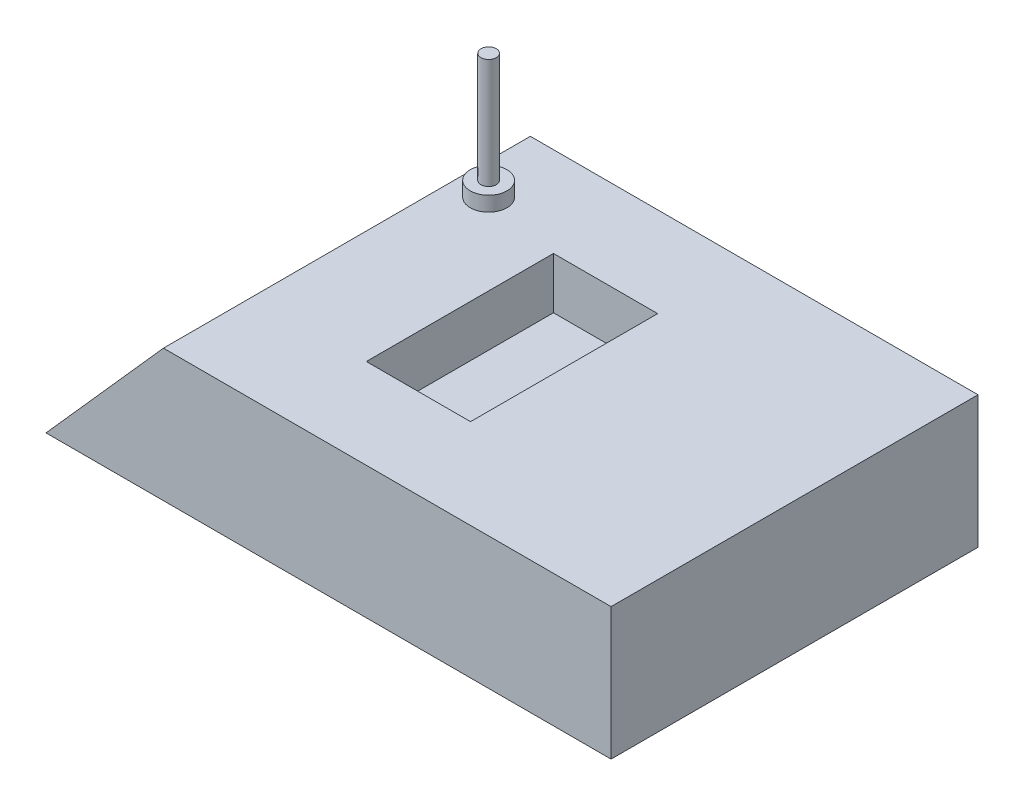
ISO-10303-21;
HEADER;
FILE_DESCRIPTION(('STEP AP214'),'2;1');
FILE_NAME('part.step','',(''),(''),'','','');
FILE_SCHEMA(('AUTOMOTIVE_DESIGN { 1 0 10303 214 1 1 1 1 }'));
ENDSEC;
DATA;
#1=APPLICATION_CONTEXT('core data for automotive mechanical design processes');
#2=APPLICATION_PROTOCOL_DEFINITION('international standard','automotive_design',2000,#1);
#3=PRODUCT_CONTEXT('',#1,'mechanical');
#4=PRODUCT('Part','Part','',(#3));
#5=PRODUCT_RELATED_PRODUCT_CATEGORY('part','',(#4));
#6=PRODUCT_DEFINITION_FORMATION('','',#4);
#7=PRODUCT_DEFINITION_CONTEXT('part definition',#1,'design');
#8=PRODUCT_DEFINITION('design','',#6,#7);
#9=PRODUCT_DEFINITION_SHAPE('','',#8);
#10=(LENGTH_UNIT() NAMED_UNIT(*) SI_UNIT(.MILLI.,.METRE.));
#11=(NAMED_UNIT(*) PLANE_ANGLE_UNIT() SI_UNIT($,.RADIAN.));
#12=(NAMED_UNIT(*) SI_UNIT($,.STERADIAN.) SOLID_ANGLE_UNIT());
#13=UNCERTAINTY_MEASURE_WITH_UNIT(LENGTH_MEASURE(1.E-05),#10,'distance_accuracy_value','');
#14=(GEOMETRIC_REPRESENTATION_CONTEXT(3) GLOBAL_UNCERTAINTY_ASSIGNED_CONTEXT((#13)) GLOBAL_UNIT_ASSIGNED_CONTEXT((#10,
#11,#12)) REPRESENTATION_CONTEXT('',''));
#15=CARTESIAN_POINT('',(0.,0.,0.));
#16=DIRECTION('',(0.,0.,1.));
#17=DIRECTION('',(1.,0.,0.));
#18=AXIS2_PLACEMENT_3D('',#15,#16,#17);
#19=CARTESIAN_POINT('',(-385.,0.,-250.));
#20=DIRECTION('',(0.74740931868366,-0.66436383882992,0.));
#21=DIRECTION('',(0.66436383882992,0.74740931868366,0.));
#22=AXIS2_PLACEMENT_3D('',#19,#20,#21);
#23=PLANE('',#22);
#24=CARTESIAN_POINT('',(-305.,90.,126.057791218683));
#25=DIRECTION('',(0.74740931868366,-0.66436383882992,0.));
#26=DIRECTION('',(-0.66436383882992,-0.74740931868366,0.));
#27=AXIS2_PLACEMENT_3D('',#24,#25,#26);
#28=ELLIPSE('',#27,112.889949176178,75.);
#29=CARTESIAN_POINT('',(-367.222222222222,20.,167.931351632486));
#30=VERTEX_POINT('',#29);
#31=CARTESIAN_POINT('',(-367.222222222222,20.,84.1842308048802));
#32=VERTEX_POINT('',#31);
#33=EDGE_CURVE('E123',#30,#32,#28,.F.);
#34=ORIENTED_EDGE('',*,*,#33,.F.);
#35=DIRECTION('',(0.,0.,1.));
#36=VECTOR('',#35,1.);
#37=CARTESIAN_POINT('',(-367.222222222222,20.,-250.));
#38=LINE('',#37,#36);
#39=EDGE_CURVE('E126',#32,#30,#38,.T.);
#40=ORIENTED_EDGE('',*,*,#39,.F.);
#41=EDGE_LOOP('',(#34,#40));
#42=FACE_BOUND('',#41,.T.);
#43=DIRECTION('',(0.66436383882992,0.74740931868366,0.));
#44=VECTOR('',#43,1.);
#45=CARTESIAN_POINT('',(-385.,0.,250.));
#46=LINE('',#45,#44);
#47=CARTESIAN_POINT('',(-385.,0.,250.));
#48=VERTEX_POINT('',#47);
#49=CARTESIAN_POINT('',(-225.,180.,250.));
#50=VERTEX_POINT('',#49);
#51=EDGE_CURVE('E98',#48,#50,#46,.T.);
#52=ORIENTED_EDGE('',*,*,#51,.T.);
#53=DIRECTION('',(0.,0.,1.));
#54=VECTOR('',#53,1.);
#55=CARTESIAN_POINT('',(-225.,180.,-250.));
#56=LINE('',#55,#54);
#57=CARTESIAN_POINT('',(-225.,180.,-250.));
#58=VERTEX_POINT('',#57);
#59=EDGE_CURVE('E94',#58,#50,#56,.T.);
#60=ORIENTED_EDGE('',*,*,#59,.F.);
#61=DIRECTION('',(0.66436383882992,0.74740931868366,0.));
#62=VECTOR('',#61,1.);
#63=CARTESIAN_POINT('',(-385.,0.,-250.));
#64=LINE('',#63,#62);
#65=CARTESIAN_POINT('',(-385.,0.,-250.));
#66=VERTEX_POINT('',#65);
#67=EDGE_CURVE('E88',#66,#58,#64,.T.);
#68=ORIENTED_EDGE('',*,*,#67,.F.);
#69=DIRECTION('',(0.,0.,1.));
#70=VECTOR('',#69,1.);
#71=CARTESIAN_POINT('',(-385.,0.,-250.));
#72=LINE('',#71,#70);
#73=EDGE_CURVE('E92',#66,#48,#72,.T.);
#74=ORIENTED_EDGE('',*,*,#73,.T.);
#75=EDGE_LOOP('',(#52,#60,#68,#74));
#76=FACE_BOUND('',#75,.T.);
#77=ADVANCED_FACE('F45',(#42,#76),#23,.F.);
#78=CARTESIAN_POINT('',(-385.,180.,-250.));
#79=DIRECTION('',(0.,0.,-1.));
#80=DIRECTION('',(-1.,0.,0.));
#81=AXIS2_PLACEMENT_3D('',#78,#79,#80);
#82=PLANE('',#81);
#83=ORIENTED_EDGE('',*,*,#67,.T.);
#84=DIRECTION('',(1.,0.,0.));
#85=VECTOR('',#84,1.);
#86=CARTESIAN_POINT('',(-385.,180.,-250.));
#87=LINE('',#86,#85);
#88=CARTESIAN_POINT('',(385.,180.,-250.));
#89=VERTEX_POINT('',#88);
#90=EDGE_CURVE('E108',#58,#89,#87,.T.);
#91=ORIENTED_EDGE('',*,*,#90,.T.);
#92=DIRECTION('',(0.,-1.,0.));
#93=VECTOR('',#92,1.);
#94=CARTESIAN_POINT('',(385.,180.,-250.));
#95=LINE('',#94,#93);
#96=CARTESIAN_POINT('',(385.,0.,-250.));
#97=VERTEX_POINT('',#96);
#98=EDGE_CURVE('E111',#89,#97,#95,.T.);
#99=ORIENTED_EDGE('',*,*,#98,.T.);
#100=DIRECTION('',(1.,0.,0.));
#101=VECTOR('',#100,1.);
#102=CARTESIAN_POINT('',(-385.,0.,-250.));
#103=LINE('',#102,#101);
#104=EDGE_CURVE('E105',#66,#97,#103,.T.);
#105=ORIENTED_EDGE('',*,*,#104,.F.);
#106=EDGE_LOOP('',(#83,#91,#99,#105));
#107=FACE_BOUND('',#106,.T.);
#108=ADVANCED_FACE('F47',(#107),#82,.T.);
#109=CARTESIAN_POINT('',(-385.,180.,250.));
#110=DIRECTION('',(0.,0.,-1.));
#111=DIRECTION('',(-1.,0.,0.));
#112=AXIS2_PLACEMENT_3D('',#109,#110,#111);
#113=PLANE('',#112);
#114=DIRECTION('',(1.,0.,0.));
#115=VECTOR('',#114,1.);
#116=CARTESIAN_POINT('',(-385.,180.,250.));
#117=LINE('',#116,#115);
#118=CARTESIAN_POINT('',(385.,180.,250.));
#119=VERTEX_POINT('',#118);
#120=EDGE_CURVE('E70',#50,#119,#117,.T.);
#121=ORIENTED_EDGE('',*,*,#120,.F.);
#122=ORIENTED_EDGE('',*,*,#51,.F.);
#123=DIRECTION('',(1.,0.,0.));
#124=VECTOR('',#123,1.);
#125=CARTESIAN_POINT('',(-385.,0.,250.));
#126=LINE('',#125,#124);
#127=CARTESIAN_POINT('',(385.,0.,250.));
#128=VERTEX_POINT('',#127);
#129=EDGE_CURVE('E107',#48,#128,#126,.T.);
#130=ORIENTED_EDGE('',*,*,#129,.T.);
#131=DIRECTION('',(0.,-1.,0.));
#132=VECTOR('',#131,1.);
#133=CARTESIAN_POINT('',(385.,180.,250.));
#134=LINE('',#133,#132);
#135=EDGE_CURVE('E121',#119,#128,#134,.T.);
#136=ORIENTED_EDGE('',*,*,#135,.F.);
#137=EDGE_LOOP('',(#121,#122,#130,#136));
#138=FACE_BOUND('',#137,.T.);
#139=ADVANCED_FACE('F218',(#138),#113,.F.);
#140=CARTESIAN_POINT('',(385.,180.,-250.));
#141=DIRECTION('',(1.,0.,0.));
#142=DIRECTION('',(0.,0.,-1.));
#143=AXIS2_PLACEMENT_3D('',#140,#141,#142);
#144=PLANE('',#143);
#145=DIRECTION('',(0.,0.,1.));
#146=VECTOR('',#145,1.);
#147=CARTESIAN_POINT('',(385.,0.,-250.));
#148=LINE('',#147,#146);
#149=EDGE_CURVE('E113',#97,#128,#148,.T.);
#150=ORIENTED_EDGE('',*,*,#149,.F.);
#151=ORIENTED_EDGE('',*,*,#98,.F.);
#152=DIRECTION('',(0.,0.,1.));
#153=VECTOR('',#152,1.);
#154=CARTESIAN_POINT('',(385.,180.,-250.));
#155=LINE('',#154,#153);
#156=EDGE_CURVE('E145',#89,#119,#155,.T.);
#157=ORIENTED_EDGE('',*,*,#156,.T.);
#158=ORIENTED_EDGE('',*,*,#135,.T.);
#159=EDGE_LOOP('',(#150,#151,#157,#158));
#160=FACE_BOUND('',#159,.T.);
#161=ADVANCED_FACE('F140',(#160),#144,.T.);
#162=CARTESIAN_POINT('',(0.,180.,0.));
#163=DIRECTION('',(0.,-1.,0.));
#164=DIRECTION('',(0.,0.,-1.));
#165=AXIS2_PLACEMENT_3D('',#162,#163,#164);
#166=PLANE('',#165);
#167=DIRECTION('',(-1.,0.,0.));
#168=VECTOR('',#167,1.);
#169=CARTESIAN_POINT('',(-71.,180.,-127.5));
#170=LINE('',#169,#168);
#171=CARTESIAN_POINT('',(71.,180.,-127.5));
#172=VERTEX_POINT('',#171);
#173=CARTESIAN_POINT('',(-71.,180.,-127.5));
#174=VERTEX_POINT('',#173);
#175=EDGE_CURVE('E176',#172,#174,#170,.T.);
#176=ORIENTED_EDGE('',*,*,#175,.F.);
#177=DIRECTION('',(0.,0.,-1.));
#178=VECTOR('',#177,1.);
#179=CARTESIAN_POINT('',(71.,180.,-127.5));
#180=LINE('',#179,#178);
#181=CARTESIAN_POINT('',(71.,180.,127.5));
#182=VERTEX_POINT('',#181);
#183=EDGE_CURVE('E61',#182,#172,#180,.T.);
#184=ORIENTED_EDGE('',*,*,#183,.F.);
#185=DIRECTION('',(1.,0.,0.));
#186=VECTOR('',#185,1.);
#187=CARTESIAN_POINT('',(-71.,180.,127.5));
#188=LINE('',#187,#186);
#189=CARTESIAN_POINT('',(-71.,180.,127.5));
#190=VERTEX_POINT('',#189);
#191=EDGE_CURVE('E169',#190,#182,#188,.T.);
#192=ORIENTED_EDGE('',*,*,#191,.F.);
#193=DIRECTION('',(0.,0.,1.));
#194=VECTOR('',#193,1.);
#195=CARTESIAN_POINT('',(-71.,180.,-127.5));
#196=LINE('',#195,#194);
#197=EDGE_CURVE('E173',#174,#190,#196,.T.);
#198=ORIENTED_EDGE('',*,*,#197,.F.);
#199=EDGE_LOOP('',(#176,#184,#192,#198));
#200=FACE_BOUND('',#199,.T.);
#201=CARTESIAN_POINT('',(-181.542171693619,180.,-149.698427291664));
#202=DIRECTION('',(0.,-1.,0.));
#203=DIRECTION('',(0.,0.,-1.));
#204=AXIS2_PLACEMENT_3D('',#201,#202,#203);
#205=CIRCLE('',#204,25.);
#206=CARTESIAN_POINT('',(-181.542171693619,180.,-174.698427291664));
#207=VERTEX_POINT('',#206);
#208=EDGE_CURVE('E49',#207,#207,#205,.F.);
#209=ORIENTED_EDGE('',*,*,#208,.F.);
#210=EDGE_LOOP('',(#209));
#211=FACE_BOUND('',#210,.T.);
#212=ORIENTED_EDGE('',*,*,#90,.F.);
#213=ORIENTED_EDGE('',*,*,#59,.T.);
#214=ORIENTED_EDGE('',*,*,#120,.T.);
#215=ORIENTED_EDGE('',*,*,#156,.F.);
#216=EDGE_LOOP('',(#212,#213,#214,#215));
#217=FACE_BOUND('',#216,.T.);
#218=ADVANCED_FACE('F138',(#200,#211,#217),#166,.F.);
#219=CARTESIAN_POINT('',(0.,0.,0.));
#220=DIRECTION('',(0.,-1.,0.));
#221=DIRECTION('',(0.,0.,-1.));
#222=AXIS2_PLACEMENT_3D('',#219,#220,#221);
#223=PLANE('',#222);
#224=ORIENTED_EDGE('',*,*,#104,.T.);
#225=ORIENTED_EDGE('',*,*,#149,.T.);
#226=ORIENTED_EDGE('',*,*,#129,.F.);
#227=ORIENTED_EDGE('',*,*,#73,.F.);
#228=EDGE_LOOP('',(#224,#225,#226,#227));
#229=FACE_BOUND('',#228,.T.);
#230=ADVANCED_FACE('F103',(#229),#223,.T.);
#231=CARTESIAN_POINT('',(-305.,180.,126.057791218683));
#232=DIRECTION('',(0.,-1.,0.));
#233=DIRECTION('',(0.,0.,-1.));
#234=AXIS2_PLACEMENT_3D('',#231,#232,#233);
#235=CYLINDRICAL_SURFACE('',#234,75.);
#236=ORIENTED_EDGE('',*,*,#33,.T.);
#237=CARTESIAN_POINT('',(-305.,20.,126.057791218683));
#238=DIRECTION('',(0.,1.,0.));
#239=DIRECTION('',(0.,0.,1.));
#240=AXIS2_PLACEMENT_3D('',#237,#238,#239);
#241=CIRCLE('',#240,75.);
#242=EDGE_CURVE('E149',#30,#32,#241,.T.);
#243=ORIENTED_EDGE('',*,*,#242,.F.);
#244=EDGE_LOOP('',(#236,#243));
#245=FACE_BOUND('',#244,.T.);
#246=ADVANCED_FACE('F234',(#245),#235,.F.);
#247=CARTESIAN_POINT('',(-305.,20.,126.057791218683));
#248=DIRECTION('',(0.,1.,0.));
#249=DIRECTION('',(0.,0.,1.));
#250=AXIS2_PLACEMENT_3D('',#247,#248,#249);
#251=PLANE('',#250);
#252=ORIENTED_EDGE('',*,*,#39,.T.);
#253=ORIENTED_EDGE('',*,*,#242,.T.);
#254=EDGE_LOOP('',(#252,#253));
#255=FACE_BOUND('',#254,.T.);
#256=ADVANCED_FACE('F239',(#255),#251,.T.);
#257=CARTESIAN_POINT('',(-181.542171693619,200.,-149.698427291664));
#258=DIRECTION('',(0.,-1.,0.));
#259=DIRECTION('',(0.,0.,-1.));
#260=AXIS2_PLACEMENT_3D('',#257,#258,#259);
#261=CYLINDRICAL_SURFACE('',#260,25.);
#262=CARTESIAN_POINT('',(-181.542171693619,200.,-149.698427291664));
#263=DIRECTION('',(0.,1.,0.));
#264=DIRECTION('',(0.,0.,1.));
#265=AXIS2_PLACEMENT_3D('',#262,#263,#264);
#266=CIRCLE('',#265,25.);
#267=CARTESIAN_POINT('',(-181.542171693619,200.,-124.698427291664));
#268=VERTEX_POINT('',#267);
#269=EDGE_CURVE('E152',#268,#268,#266,.T.);
#270=ORIENTED_EDGE('',*,*,#269,.F.);
#271=EDGE_LOOP('',(#270));
#272=FACE_BOUND('',#271,.T.);
#273=ORIENTED_EDGE('',*,*,#208,.T.);
#274=EDGE_LOOP('',(#273));
#275=FACE_BOUND('',#274,.T.);
#276=ADVANCED_FACE('F136',(#272,#275),#261,.T.);
#277=CARTESIAN_POINT('',(-181.542171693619,200.,-149.698427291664));
#278=DIRECTION('',(0.,1.,0.));
#279=DIRECTION('',(0.,0.,1.));
#280=AXIS2_PLACEMENT_3D('',#277,#278,#279);
#281=PLANE('',#280);
#282=CARTESIAN_POINT('',(-181.542171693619,200.,-149.698427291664));
#283=DIRECTION('',(0.,1.,0.));
#284=DIRECTION('',(0.,0.,1.));
#285=AXIS2_PLACEMENT_3D('',#282,#283,#284);
#286=CIRCLE('',#285,10.5);
#287=CARTESIAN_POINT('',(-181.542171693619,200.,-139.198427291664));
#288=VERTEX_POINT('',#287);
#289=EDGE_CURVE('E11',#288,#288,#286,.T.);
#290=ORIENTED_EDGE('',*,*,#289,.F.);
#291=EDGE_LOOP('',(#290));
#292=FACE_BOUND('',#291,.T.);
#293=ORIENTED_EDGE('',*,*,#269,.T.);
#294=EDGE_LOOP('',(#293));
#295=FACE_BOUND('',#294,.T.);
#296=ADVANCED_FACE('F248',(#292,#295),#281,.T.);
#297=CARTESIAN_POINT('',(-181.542171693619,350.,-149.698427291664));
#298=DIRECTION('',(0.,-1.,0.));
#299=DIRECTION('',(0.,0.,-1.));
#300=AXIS2_PLACEMENT_3D('',#297,#298,#299);
#301=CYLINDRICAL_SURFACE('',#300,10.5);
#302=CARTESIAN_POINT('',(-181.542171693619,350.,-149.698427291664));
#303=DIRECTION('',(0.,1.,0.));
#304=DIRECTION('',(0.,0.,1.));
#305=AXIS2_PLACEMENT_3D('',#302,#303,#304);
#306=CIRCLE('',#305,10.5);
#307=CARTESIAN_POINT('',(-181.542171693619,350.,-139.198427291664));
#308=VERTEX_POINT('',#307);
#309=EDGE_CURVE('E154',#308,#308,#306,.T.);
#310=ORIENTED_EDGE('',*,*,#309,.F.);
#311=EDGE_LOOP('',(#310));
#312=FACE_BOUND('',#311,.T.);
#313=ORIENTED_EDGE('',*,*,#289,.T.);
#314=EDGE_LOOP('',(#313));
#315=FACE_BOUND('',#314,.T.);
#316=ADVANCED_FACE('F254',(#312,#315),#301,.T.);
#317=CARTESIAN_POINT('',(-181.542171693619,350.,-149.698427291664));
#318=DIRECTION('',(0.,1.,0.));
#319=DIRECTION('',(0.,0.,1.));
#320=AXIS2_PLACEMENT_3D('',#317,#318,#319);
#321=PLANE('',#320);
#322=ORIENTED_EDGE('',*,*,#309,.T.);
#323=EDGE_LOOP('',(#322));
#324=FACE_BOUND('',#323,.T.);
#325=ADVANCED_FACE('F258',(#324),#321,.T.);
#326=CARTESIAN_POINT('',(71.,110.,-127.5));
#327=DIRECTION('',(1.,0.,0.));
#328=DIRECTION('',(0.,0.,-1.));
#329=AXIS2_PLACEMENT_3D('',#326,#327,#328);
#330=PLANE('',#329);
#331=ORIENTED_EDGE('',*,*,#183,.T.);
#332=DIRECTION('',(0.,1.,0.));
#333=VECTOR('',#332,1.);
#334=CARTESIAN_POINT('',(71.,110.,-127.5));
#335=LINE('',#334,#333);
#336=CARTESIAN_POINT('',(71.,110.,-127.5));
#337=VERTEX_POINT('',#336);
#338=EDGE_CURVE('E159',#337,#172,#335,.T.);
#339=ORIENTED_EDGE('',*,*,#338,.F.);
#340=DIRECTION('',(0.,0.,-1.));
#341=VECTOR('',#340,1.);
#342=CARTESIAN_POINT('',(71.,110.,-127.5));
#343=LINE('',#342,#341);
#344=CARTESIAN_POINT('',(71.,110.,127.5));
#345=VERTEX_POINT('',#344);
#346=EDGE_CURVE('E172',#345,#337,#343,.T.);
#347=ORIENTED_EDGE('',*,*,#346,.F.);
#348=DIRECTION('',(0.,1.,0.));
#349=VECTOR('',#348,1.);
#350=CARTESIAN_POINT('',(71.,110.,127.5));
#351=LINE('',#350,#349);
#352=EDGE_CURVE('E158',#345,#182,#351,.T.);
#353=ORIENTED_EDGE('',*,*,#352,.T.);
#354=EDGE_LOOP('',(#331,#339,#347,#353));
#355=FACE_BOUND('',#354,.T.);
#356=ADVANCED_FACE('F199',(#355),#330,.F.);
#357=CARTESIAN_POINT('',(-71.,110.,127.5));
#358=DIRECTION('',(0.,0.,1.));
#359=DIRECTION('',(1.,0.,0.));
#360=AXIS2_PLACEMENT_3D('',#357,#358,#359);
#361=PLANE('',#360);
#362=ORIENTED_EDGE('',*,*,#191,.T.);
#363=ORIENTED_EDGE('',*,*,#352,.F.);
#364=DIRECTION('',(1.,0.,0.));
#365=VECTOR('',#364,1.);
#366=CARTESIAN_POINT('',(-71.,110.,127.5));
#367=LINE('',#366,#365);
#368=CARTESIAN_POINT('',(-71.,110.,127.5));
#369=VERTEX_POINT('',#368);
#370=EDGE_CURVE('E162',#369,#345,#367,.T.);
#371=ORIENTED_EDGE('',*,*,#370,.F.);
#372=DIRECTION('',(0.,1.,0.));
#373=VECTOR('',#372,1.);
#374=CARTESIAN_POINT('',(-71.,110.,127.5));
#375=LINE('',#374,#373);
#376=EDGE_CURVE('E165',#369,#190,#375,.T.);
#377=ORIENTED_EDGE('',*,*,#376,.T.);
#378=EDGE_LOOP('',(#362,#363,#371,#377));
#379=FACE_BOUND('',#378,.T.);
#380=ADVANCED_FACE('F265',(#379),#361,.F.);
#381=CARTESIAN_POINT('',(-71.,110.,-127.5));
#382=DIRECTION('',(-1.,0.,0.));
#383=DIRECTION('',(0.,0.,1.));
#384=AXIS2_PLACEMENT_3D('',#381,#382,#383);
#385=PLANE('',#384);
#386=ORIENTED_EDGE('',*,*,#197,.T.);
#387=ORIENTED_EDGE('',*,*,#376,.F.);
#388=DIRECTION('',(0.,0.,1.));
#389=VECTOR('',#388,1.);
#390=CARTESIAN_POINT('',(-71.,110.,-127.5));
#391=LINE('',#390,#389);
#392=CARTESIAN_POINT('',(-71.,110.,-127.5));
#393=VERTEX_POINT('',#392);
#394=EDGE_CURVE('E182',#393,#369,#391,.T.);
#395=ORIENTED_EDGE('',*,*,#394,.F.);
#396=DIRECTION('',(0.,1.,0.));
#397=VECTOR('',#396,1.);
#398=CARTESIAN_POINT('',(-71.,110.,-127.5));
#399=LINE('',#398,#397);
#400=EDGE_CURVE('E161',#393,#174,#399,.T.);
#401=ORIENTED_EDGE('',*,*,#400,.T.);
#402=EDGE_LOOP('',(#386,#387,#395,#401));
#403=FACE_BOUND('',#402,.T.);
#404=ADVANCED_FACE('F269',(#403),#385,.F.);
#405=CARTESIAN_POINT('',(-71.,110.,-127.5));
#406=DIRECTION('',(0.,0.,-1.));
#407=DIRECTION('',(-1.,0.,0.));
#408=AXIS2_PLACEMENT_3D('',#405,#406,#407);
#409=PLANE('',#408);
#410=ORIENTED_EDGE('',*,*,#175,.T.);
#411=ORIENTED_EDGE('',*,*,#400,.F.);
#412=DIRECTION('',(-1.,0.,0.));
#413=VECTOR('',#412,1.);
#414=CARTESIAN_POINT('',(-71.,110.,-127.5));
#415=LINE('',#414,#413);
#416=EDGE_CURVE('E185',#337,#393,#415,.T.);
#417=ORIENTED_EDGE('',*,*,#416,.F.);
#418=ORIENTED_EDGE('',*,*,#338,.T.);
#419=EDGE_LOOP('',(#410,#411,#417,#418));
#420=FACE_BOUND('',#419,.T.);
#421=ADVANCED_FACE('F266',(#420),#409,.F.);
#422=CARTESIAN_POINT('',(0.,110.,0.));
#423=DIRECTION('',(0.,1.,0.));
#424=DIRECTION('',(0.,0.,1.));
#425=AXIS2_PLACEMENT_3D('',#422,#423,#424);
#426=PLANE('',#425);
#427=ORIENTED_EDGE('',*,*,#346,.T.);
#428=ORIENTED_EDGE('',*,*,#416,.T.);
#429=ORIENTED_EDGE('',*,*,#394,.T.);
#430=ORIENTED_EDGE('',*,*,#370,.T.);
#431=EDGE_LOOP('',(#427,#428,#429,#430));
#432=FACE_BOUND('',#431,.T.);
#433=ADVANCED_FACE('F192',(#432),#426,.T.);
#434=CLOSED_SHELL('',(#77,#108,#139,#161,#218,#230,#246,#256,#276,#296,#316,#325,#356,#380,#404,
#421,#433));
#435=MANIFOLD_SOLID_BREP('B2',#434);
#436=ADVANCED_BREP_SHAPE_REPRESENTATION('',(#18,#435),#14);
#437=SHAPE_DEFINITION_REPRESENTATION(#9,#436);
ENDSEC;
END-ISO-10303-21;
